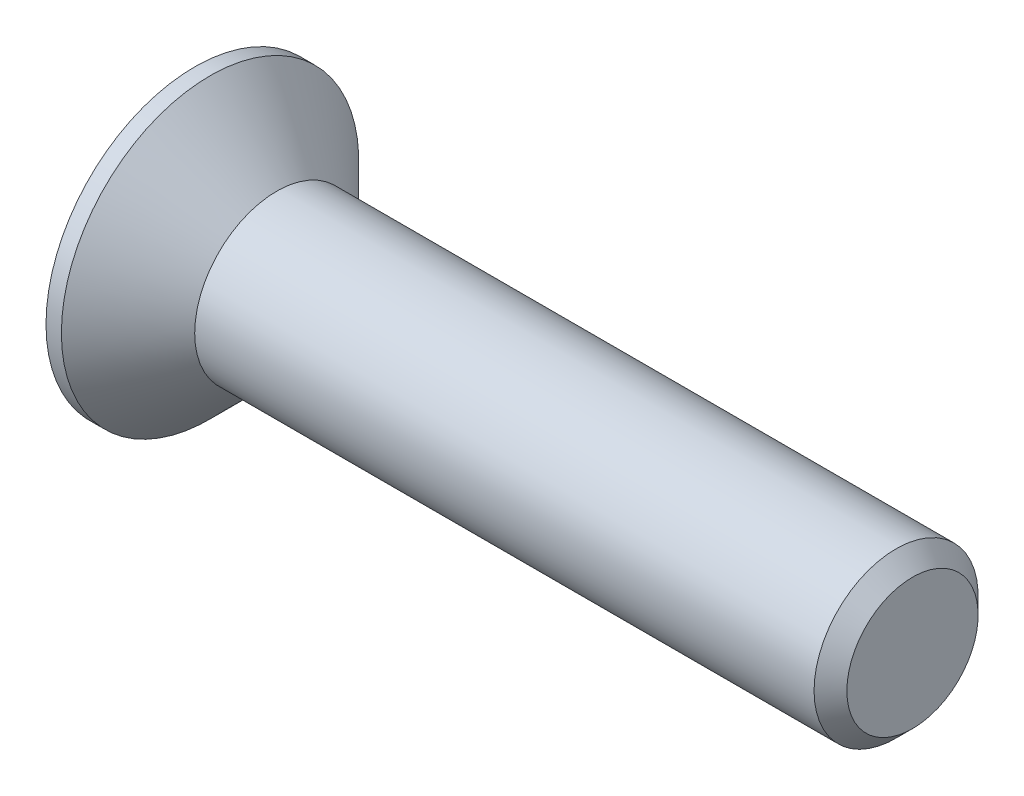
from build123d import *

# Parameters (mm, degrees)
CHAMFER1_SIZE      = 0.8
CUT_EXTRUDE1_DEPTH = 3.45


with BuildPart() as part:
    # Sketch1 → Revolve1 (revolve)
    with BuildSketch(Plane.XY, mode=Mode.PRIVATE) as revolve1_sk:
        Polygon((-4, 7.25), (-4, 0), (31, 0), (31, 4), (0, 4), (-3.25, 7.25), align=None)
    revolve(revolve1_sk.sketch.rotate(Axis((-4, 0, 0), (1, 0, 0)), 90), axis=Axis((-4, 0, 0), (1, 0, 0)))

    # Chamfer1
    chamfer1_edges = [part.edges().sort_by_distance(p)[0] for p in [
        (31, 0, -4),
    ]]
    chamfer(chamfer1_edges, length=CHAMFER1_SIZE)

    # Sketch2 → Cut-Extrude1 (cut)
    with BuildSketch(Plane.ZY.offset(4)):
        Polygon((-1.09, 4.35), (1.09, 4.35), (1.09, 1.09), (4.35, 1.09), (4.35, -1.09), (1.09, -1.09), (1.09, -4.35), (-1.09, -4.35), (-1.09, -1.09), (-4.35, -1.09), (-4.35, 1.09), (-1.09, 1.09), align=None)
    extrude(amount=-CUT_EXTRUDE1_DEPTH, mode=Mode.SUBTRACT)


solid = part.part
